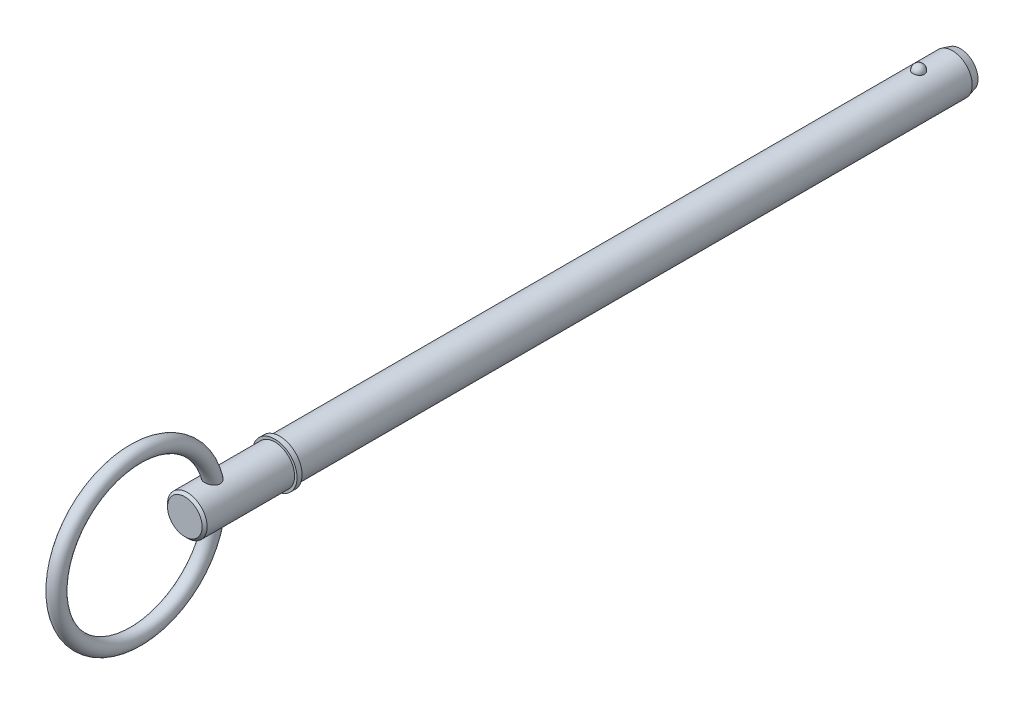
ISO-10303-21;
HEADER;
FILE_DESCRIPTION(('STEP AP214'),'2;1');
FILE_NAME('part.step','',(''),(''),'','','');
FILE_SCHEMA(('AUTOMOTIVE_DESIGN { 1 0 10303 214 1 1 1 1 }'));
ENDSEC;
DATA;
#1=APPLICATION_CONTEXT('core data for automotive mechanical design processes');
#2=APPLICATION_PROTOCOL_DEFINITION('international standard','automotive_design',2000,#1);
#3=PRODUCT_CONTEXT('',#1,'mechanical');
#4=PRODUCT('Part','Part','',(#3));
#5=PRODUCT_RELATED_PRODUCT_CATEGORY('part','',(#4));
#6=PRODUCT_DEFINITION_FORMATION('','',#4);
#7=PRODUCT_DEFINITION_CONTEXT('part definition',#1,'design');
#8=PRODUCT_DEFINITION('design','',#6,#7);
#9=PRODUCT_DEFINITION_SHAPE('','',#8);
#10=(LENGTH_UNIT() NAMED_UNIT(*) SI_UNIT(.MILLI.,.METRE.));
#11=(NAMED_UNIT(*) PLANE_ANGLE_UNIT() SI_UNIT($,.RADIAN.));
#12=(NAMED_UNIT(*) SI_UNIT($,.STERADIAN.) SOLID_ANGLE_UNIT());
#13=UNCERTAINTY_MEASURE_WITH_UNIT(LENGTH_MEASURE(1.E-05),#10,'distance_accuracy_value','');
#14=(GEOMETRIC_REPRESENTATION_CONTEXT(3) GLOBAL_UNCERTAINTY_ASSIGNED_CONTEXT((#13)) GLOBAL_UNIT_ASSIGNED_CONTEXT((#10,
#11,#12)) REPRESENTATION_CONTEXT('',''));
#15=CARTESIAN_POINT('',(0.,0.,0.));
#16=DIRECTION('',(0.,0.,1.));
#17=DIRECTION('',(1.,0.,0.));
#18=AXIS2_PLACEMENT_3D('',#15,#16,#17);
#19=CARTESIAN_POINT('',(0.,0.,127.));
#20=DIRECTION('',(0.,0.,-1.));
#21=DIRECTION('',(-1.,0.,0.));
#22=AXIS2_PLACEMENT_3D('',#19,#20,#21);
#23=CYLINDRICAL_SURFACE('',#22,3.97);
#24=CARTESIAN_POINT('',(1.13787398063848,3.80343828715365,-1.14999999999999));
#25=CARTESIAN_POINT('',(1.13787307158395,3.80343910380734,-1.08573978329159));
#26=CARTESIAN_POINT('',(1.13264657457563,3.80501406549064,-1.02146820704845));
#27=CARTESIAN_POINT('',(1.11186534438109,3.81113760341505,-0.89474994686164));
#28=CARTESIAN_POINT('',(1.09630734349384,3.81568712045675,-0.832303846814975));
#29=CARTESIAN_POINT('',(1.05525533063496,3.82724281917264,-0.711040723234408));
#30=CARTESIAN_POINT('',(1.02976565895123,3.83424792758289,-0.652222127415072));
#31=CARTESIAN_POINT('',(0.969477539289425,3.84993235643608,-0.539814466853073));
#32=CARTESIAN_POINT('',(0.934679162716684,3.85861166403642,-0.486225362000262));
#33=CARTESIAN_POINT('',(0.856427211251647,3.87673176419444,-0.385470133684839));
#34=CARTESIAN_POINT('',(0.812928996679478,3.88617632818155,-0.338339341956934));
#35=CARTESIAN_POINT('',(0.718506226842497,3.90473543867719,-0.252134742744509));
#36=CARTESIAN_POINT('',(0.667581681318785,3.91384998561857,-0.213060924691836));
#37=CARTESIAN_POINT('',(0.559829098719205,3.93070626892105,-0.144169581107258));
#38=CARTESIAN_POINT('',(0.503019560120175,3.93845211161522,-0.114324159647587));
#39=CARTESIAN_POINT('',(0.384957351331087,3.95173781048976,-0.0645874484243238));
#40=CARTESIAN_POINT('',(0.323705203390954,3.95727792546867,-0.044694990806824));
#41=CARTESIAN_POINT('',(0.1997490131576,3.96544869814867,-0.015729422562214));
#42=CARTESIAN_POINT('',(0.137095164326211,3.96813298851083,-0.00645660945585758));
#43=CARTESIAN_POINT('',(0.0110617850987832,3.97048461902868,0.0016793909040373));
#44=CARTESIAN_POINT('',(-0.0523176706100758,3.97015226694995,0.00054364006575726));
#45=CARTESIAN_POINT('',(-0.176983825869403,3.96653606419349,-0.0120046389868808));
#46=CARTESIAN_POINT('',(-0.238287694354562,3.96329719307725,-0.0232605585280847));
#47=CARTESIAN_POINT('',(-0.358077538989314,3.95427494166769,-0.0555133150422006));
#48=CARTESIAN_POINT('',(-0.41656346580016,3.94849151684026,-0.0765103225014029));
#49=CARTESIAN_POINT('',(-0.529474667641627,3.9349475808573,-0.127824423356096));
#50=CARTESIAN_POINT('',(-0.583873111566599,3.92717527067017,-0.158197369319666));
#51=CARTESIAN_POINT('',(-0.686796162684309,3.9104901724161,-0.227402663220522));
#52=CARTESIAN_POINT('',(-0.735320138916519,3.90157726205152,-0.266235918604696));
#53=CARTESIAN_POINT('',(-0.826197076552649,3.88336108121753,-0.352210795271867));
#54=CARTESIAN_POINT('',(-0.868404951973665,3.87405356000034,-0.399504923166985));
#55=CARTESIAN_POINT('',(-0.944393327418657,3.85623507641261,-0.500572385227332));
#56=CARTESIAN_POINT('',(-0.978173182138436,3.84772417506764,-0.5543462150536));
#57=CARTESIAN_POINT('',(-1.036841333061,3.83233550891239,-0.66762403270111));
#58=CARTESIAN_POINT('',(-1.06161430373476,3.82547928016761,-0.727190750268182));
#59=CARTESIAN_POINT('',(-1.1010562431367,3.81431496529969,-0.849806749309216));
#60=CARTESIAN_POINT('',(-1.11572551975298,3.81000680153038,-0.9128559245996));
#61=CARTESIAN_POINT('',(-1.13455293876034,3.80444307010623,-1.0403529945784));
#62=CARTESIAN_POINT('',(-1.13875701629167,3.80317416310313,-1.10479351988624));
#63=CARTESIAN_POINT('',(-1.13668244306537,3.80379469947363,-1.23348881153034));
#64=CARTESIAN_POINT('',(-1.13040410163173,3.80568404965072,-1.29774358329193));
#65=CARTESIAN_POINT('',(-1.10758455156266,3.81238701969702,-1.42388263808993));
#66=CARTESIAN_POINT('',(-1.09109911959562,3.81718474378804,-1.48577787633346));
#67=CARTESIAN_POINT('',(-1.04831897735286,3.82915360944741,-1.60583632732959));
#68=CARTESIAN_POINT('',(-1.02202385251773,3.83632485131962,-1.66399938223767));
#69=CARTESIAN_POINT('',(-0.960087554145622,3.85229234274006,-1.77531672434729));
#70=CARTESIAN_POINT('',(-0.924393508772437,3.86109769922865,-1.82844028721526));
#71=CARTESIAN_POINT('',(-0.844617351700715,3.87932868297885,-1.9278464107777));
#72=CARTESIAN_POINT('',(-0.800534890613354,3.88875433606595,-1.97412868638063));
#73=CARTESIAN_POINT('',(-0.704909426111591,3.90722138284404,-2.05875748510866));
#74=CARTESIAN_POINT('',(-0.653336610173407,3.91626104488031,-2.09707073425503));
#75=CARTESIAN_POINT('',(-0.544251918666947,3.93290335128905,-2.16444159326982));
#76=CARTESIAN_POINT('',(-0.486740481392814,3.94050610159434,-2.19349988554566));
#77=CARTESIAN_POINT('',(-0.368186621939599,3.95333328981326,-2.2412060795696));
#78=CARTESIAN_POINT('',(-0.307200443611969,3.9585876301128,-2.25998559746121));
#79=CARTESIAN_POINT('',(-0.182787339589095,3.96627905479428,-2.28716436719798));
#80=CARTESIAN_POINT('',(-0.119360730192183,3.96871650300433,-2.29556495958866));
#81=CARTESIAN_POINT('',(0.00676344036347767,3.97048518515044,-2.30167748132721));
#82=CARTESIAN_POINT('',(0.0694499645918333,3.96987797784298,-2.29960123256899));
#83=CARTESIAN_POINT('',(0.193555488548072,3.96576491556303,-2.28530777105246));
#84=CARTESIAN_POINT('',(0.254974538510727,3.96225917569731,-2.2730909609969));
#85=CARTESIAN_POINT('',(0.374550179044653,3.95274547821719,-2.23893840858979));
#86=CARTESIAN_POINT('',(0.432719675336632,3.94674835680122,-2.21704472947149));
#87=CARTESIAN_POINT('',(0.544514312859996,3.93288448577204,-2.16414952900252));
#88=CARTESIAN_POINT('',(0.598139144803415,3.92501760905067,-2.13314738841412));
#89=CARTESIAN_POINT('',(0.700284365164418,3.90809781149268,-2.06228741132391));
#90=CARTESIAN_POINT('',(0.748708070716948,3.89902775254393,-2.0222943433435));
#91=CARTESIAN_POINT('',(0.838215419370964,3.88077133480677,-1.93481443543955));
#92=CARTESIAN_POINT('',(0.879297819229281,3.87158495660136,-1.88732632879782));
#93=CARTESIAN_POINT('',(0.953804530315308,3.85391414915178,-1.78516284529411));
#94=CARTESIAN_POINT('',(0.987071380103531,3.8454460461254,-1.73036973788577));
#95=CARTESIAN_POINT('',(1.04410491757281,3.83035507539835,-1.61582422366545));
#96=CARTESIAN_POINT('',(1.06787445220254,3.82373165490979,-1.55607330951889));
#97=CARTESIAN_POINT('',(1.10358064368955,3.813570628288,-1.43904746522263));
#98=CARTESIAN_POINT('',(1.11641754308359,3.80980198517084,-1.38206535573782));
#99=CARTESIAN_POINT('',(1.13356451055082,3.80473547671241,-1.26672526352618));
#100=CARTESIAN_POINT('',(1.13787480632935,3.80343754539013,-1.20836731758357));
#101=CARTESIAN_POINT('',(1.13787398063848,3.80343828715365,-1.14999999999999));
#102=B_SPLINE_CURVE_WITH_KNOTS('',3,(#24,#25,#26,#27,#28,#29,#30,#31,#32,#33,#34,#35,#36,#37,
#38,#39,#40,#41,#42,#43,#44,#45,#46,#47,#48,#49,#50,#51,#52,#53,#54,#55,#56,#57,#58,#59,#60,#61,
#62,#63,#64,#65,#66,#67,#68,#69,#70,#71,#72,#73,#74,#75,#76,#77,#78,#79,#80,#81,#82,#83,#84,#85,
#86,#87,#88,#89,#90,#91,#92,#93,#94,#95,#96,#97,#98,#99,#100,#101),.UNSPECIFIED.,.T.,.F.,(4,2,2,
2,2,2,2,2,2,2,2,2,2,2,2,2,2,2,2,2,2,2,2,2,2,2,2,2,2,2,2,2,2,2,2,2,2,2,4),(0.,0.192571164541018,
0.385203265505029,0.577751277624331,0.770297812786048,0.963858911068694,1.15741975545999,
1.35038964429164,1.54333688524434,1.73259288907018,1.92182958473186,2.10818732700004,
2.2945483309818,2.48204164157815,2.66955507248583,2.86087083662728,3.05220124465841,
3.24590171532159,3.43959628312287,3.63243915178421,3.82527632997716,4.01706893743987,
4.20886965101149,4.40177324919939,4.59468488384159,4.78838651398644,4.9820738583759,
5.17321934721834,5.36434014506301,5.55161251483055,5.7388774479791,5.92533626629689,
6.11180776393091,6.30129785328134,6.49082000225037,6.68388392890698,6.87688993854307,
7.05180628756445,7.22671796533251),.UNSPECIFIED.);
#103=CARTESIAN_POINT('',(1.13787398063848,3.80343828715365,-1.14999999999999));
#104=VERTEX_POINT('',#103);
#105=EDGE_CURVE('E101',#104,#104,#102,.T.);
#106=ORIENTED_EDGE('',*,*,#105,.T.);
#107=EDGE_LOOP('',(#106));
#108=FACE_BOUND('',#107,.T.);
#109=CARTESIAN_POINT('',(0.,0.,-7.94399999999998));
#110=DIRECTION('',(0.,0.,-1.));
#111=DIRECTION('',(-1.,0.,0.));
#112=AXIS2_PLACEMENT_3D('',#109,#110,#111);
#113=CIRCLE('',#112,3.97);
#114=CARTESIAN_POINT('',(-3.97,0.,-7.94399999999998));
#115=VERTEX_POINT('',#114);
#116=EDGE_CURVE('E109',#115,#115,#113,.F.);
#117=ORIENTED_EDGE('',*,*,#116,.T.);
#118=EDGE_LOOP('',(#117));
#119=FACE_BOUND('',#118,.T.);
#120=CARTESIAN_POINT('',(0.,0.,127.));
#121=DIRECTION('',(0.,0.,1.));
#122=DIRECTION('',(1.,0.,0.));
#123=AXIS2_PLACEMENT_3D('',#120,#121,#122);
#124=CIRCLE('',#123,3.97);
#125=CARTESIAN_POINT('',(3.97,0.,127.));
#126=VERTEX_POINT('',#125);
#127=EDGE_CURVE('E107',#126,#126,#124,.T.);
#128=ORIENTED_EDGE('',*,*,#127,.F.);
#129=EDGE_LOOP('',(#128));
#130=FACE_BOUND('',#129,.T.);
#131=ADVANCED_FACE('F39',(#108,#119,#130),#23,.T.);
#132=CARTESIAN_POINT('',(0.,0.,-9.53));
#133=DIRECTION('',(0.,0.,-1.));
#134=DIRECTION('',(-1.,0.,0.));
#135=AXIS2_PLACEMENT_3D('',#132,#133,#134);
#136=PLANE('',#135);
#137=CARTESIAN_POINT('',(0.,0.,-9.53));
#138=DIRECTION('',(0.,0.,-1.));
#139=DIRECTION('',(-1.,0.,0.));
#140=AXIS2_PLACEMENT_3D('',#137,#138,#139);
#141=CIRCLE('',#140,3.54503258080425);
#142=CARTESIAN_POINT('',(-3.54503258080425,0.,-9.53));
#143=VERTEX_POINT('',#142);
#144=EDGE_CURVE('E142',#143,#143,#141,.T.);
#145=ORIENTED_EDGE('',*,*,#144,.T.);
#146=EDGE_LOOP('',(#145));
#147=FACE_BOUND('',#146,.T.);
#148=ADVANCED_FACE('F87',(#147),#136,.T.);
#149=CARTESIAN_POINT('',(0.,0.,-9.53000000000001));
#150=DIRECTION('',(0.,0.,1.));
#151=DIRECTION('',(1.,0.,0.));
#152=AXIS2_PLACEMENT_3D('',#149,#150,#151);
#153=CONICAL_SURFACE('',#152,3.54503258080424,0.261799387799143);
#154=ORIENTED_EDGE('',*,*,#116,.F.);
#155=EDGE_LOOP('',(#154));
#156=FACE_BOUND('',#155,.T.);
#157=ORIENTED_EDGE('',*,*,#144,.F.);
#158=EDGE_LOOP('',(#157));
#159=FACE_BOUND('',#158,.T.);
#160=ADVANCED_FACE('F93',(#156,#159),#153,.T.);
#161=CARTESIAN_POINT('',(0.,3.97,-1.14999999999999));
#162=DIRECTION('',(0.,1.,0.));
#163=DIRECTION('',(0.,0.,-1.));
#164=AXIS2_PLACEMENT_3D('',#161,#162,#163);
#165=SPHERICAL_SURFACE('',#164,1.15);
#166=ORIENTED_EDGE('',*,*,#105,.F.);
#167=EDGE_LOOP('',(#166));
#168=FACE_BOUND('',#167,.T.);
#169=ADVANCED_FACE('F112',(#168),#165,.T.);
#170=CARTESIAN_POINT('',(0.,0.,127.));
#171=DIRECTION('',(0.,0.,-1.));
#172=DIRECTION('',(-1.,0.,0.));
#173=AXIS2_PLACEMENT_3D('',#170,#171,#172);
#174=PLANE('',#173);
#175=ORIENTED_EDGE('',*,*,#127,.T.);
#176=EDGE_LOOP('',(#175));
#177=FACE_BOUND('',#176,.T.);
#178=CARTESIAN_POINT('',(0.,0.,127.));
#179=DIRECTION('',(0.,0.,-1.));
#180=DIRECTION('',(-1.,0.,0.));
#181=AXIS2_PLACEMENT_3D('',#178,#179,#180);
#182=CIRCLE('',#181,4.47);
#183=CARTESIAN_POINT('',(-4.47,0.,127.));
#184=VERTEX_POINT('',#183);
#185=EDGE_CURVE('E108',#184,#184,#182,.T.);
#186=ORIENTED_EDGE('',*,*,#185,.T.);
#187=EDGE_LOOP('',(#186));
#188=FACE_BOUND('',#187,.T.);
#189=ADVANCED_FACE('F116',(#177,#188),#174,.T.);
#190=CARTESIAN_POINT('',(0.,0.,33.7287874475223));
#191=DIRECTION('',(0.,0.,-1.));
#192=DIRECTION('',(-1.,0.,0.));
#193=AXIS2_PLACEMENT_3D('',#190,#191,#192);
#194=CYLINDRICAL_SURFACE('',#193,4.47);
#195=CARTESIAN_POINT('',(0.,0.,128.));
#196=DIRECTION('',(0.,0.,-1.));
#197=DIRECTION('',(-1.,0.,0.));
#198=AXIS2_PLACEMENT_3D('',#195,#196,#197);
#199=CIRCLE('',#198,4.47);
#200=CARTESIAN_POINT('',(-4.47,0.,128.));
#201=VERTEX_POINT('',#200);
#202=EDGE_CURVE('E133',#201,#201,#199,.T.);
#203=ORIENTED_EDGE('',*,*,#202,.T.);
#204=EDGE_LOOP('',(#203));
#205=FACE_BOUND('',#204,.T.);
#206=ORIENTED_EDGE('',*,*,#185,.F.);
#207=EDGE_LOOP('',(#206));
#208=FACE_BOUND('',#207,.T.);
#209=ADVANCED_FACE('F120',(#205,#208),#194,.T.);
#210=CARTESIAN_POINT('',(0.,4.47,128.));
#211=DIRECTION('',(0.,0.,1.));
#212=DIRECTION('',(1.,0.,0.));
#213=AXIS2_PLACEMENT_3D('',#210,#211,#212);
#214=PLANE('',#213);
#215=CARTESIAN_POINT('',(0.,0.,128.));
#216=DIRECTION('',(0.,0.,1.));
#217=DIRECTION('',(1.,0.,0.));
#218=AXIS2_PLACEMENT_3D('',#215,#216,#217);
#219=CIRCLE('',#218,3.97);
#220=CARTESIAN_POINT('',(3.97,0.,128.));
#221=VERTEX_POINT('',#220);
#222=EDGE_CURVE('E111',#221,#221,#219,.T.);
#223=ORIENTED_EDGE('',*,*,#222,.F.);
#224=EDGE_LOOP('',(#223));
#225=FACE_BOUND('',#224,.T.);
#226=ORIENTED_EDGE('',*,*,#202,.F.);
#227=EDGE_LOOP('',(#226));
#228=FACE_BOUND('',#227,.T.);
#229=ADVANCED_FACE('F84',(#225,#228),#214,.T.);
#230=CARTESIAN_POINT('',(0.,0.,146.05));
#231=DIRECTION('',(0.,0.,-1.));
#232=DIRECTION('',(-1.,0.,0.));
#233=AXIS2_PLACEMENT_3D('',#230,#231,#232);
#234=CYLINDRICAL_SURFACE('',#233,3.97);
#235=CARTESIAN_POINT('',(-0.740636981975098,-3.90030215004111,139.194208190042));
#236=CARTESIAN_POINT('',(-0.667733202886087,-3.91414543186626,139.154930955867));
#237=CARTESIAN_POINT('',(-0.59134710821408,-3.92651643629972,139.121598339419));
#238=CARTESIAN_POINT('',(-0.433709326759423,-3.94703799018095,139.067541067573));
#239=CARTESIAN_POINT('',(-0.352458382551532,-3.95518918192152,139.04681449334));
#240=CARTESIAN_POINT('',(-0.187320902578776,-3.96644185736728,139.018426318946));
#241=CARTESIAN_POINT('',(-0.103433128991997,-3.9695409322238,139.010770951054));
#242=CARTESIAN_POINT('',(0.0645297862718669,-3.97036376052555,139.008726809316));
#243=CARTESIAN_POINT('',(0.148604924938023,-3.96808759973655,139.014337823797));
#244=CARTESIAN_POINT('',(0.313967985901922,-3.95842655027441,139.038610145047));
#245=CARTESIAN_POINT('',(0.39527075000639,-3.95107581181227,139.057184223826));
#246=CARTESIAN_POINT('',(0.553418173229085,-3.93204472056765,139.106869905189));
#247=CARTESIAN_POINT('',(0.630262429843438,-3.92036397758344,139.137982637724));
#248=CARTESIAN_POINT('',(0.777983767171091,-3.89375421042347,139.212373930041));
#249=CARTESIAN_POINT('',(0.848809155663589,-3.8788003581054,139.255746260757));
#250=CARTESIAN_POINT('',(0.98188081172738,-3.84727071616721,139.353651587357));
#251=CARTESIAN_POINT('',(1.04412630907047,-3.83069478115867,139.408185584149));
#252=CARTESIAN_POINT('',(1.15846819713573,-3.79768496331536,139.527439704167));
#253=CARTESIAN_POINT('',(1.21053047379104,-3.78125172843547,139.592192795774));
#254=CARTESIAN_POINT('',(1.30266807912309,-3.75050988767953,139.730169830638));
#255=CARTESIAN_POINT('',(1.34274789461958,-3.73620048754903,139.803390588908));
#256=CARTESIAN_POINT('',(1.40857853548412,-3.71187334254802,139.953627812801));
#257=CARTESIAN_POINT('',(1.43477198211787,-3.70172571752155,140.030429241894));
#258=CARTESIAN_POINT('',(1.47426417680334,-3.68617713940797,140.187721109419));
#259=CARTESIAN_POINT('',(1.48756557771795,-3.68077520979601,140.268210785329));
#260=CARTESIAN_POINT('',(1.5011302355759,-3.67526295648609,140.428277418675));
#261=CARTESIAN_POINT('',(1.50172918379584,-3.67501639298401,140.507822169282));
#262=CARTESIAN_POINT('',(1.49128692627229,-3.67926498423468,140.666001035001));
#263=CARTESIAN_POINT('',(1.48024221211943,-3.68376156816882,140.744634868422));
#264=CARTESIAN_POINT('',(1.44631002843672,-3.69722026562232,140.903996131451));
#265=CARTESIAN_POINT('',(1.42273446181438,-3.70644057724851,140.984553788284));
#266=CARTESIAN_POINT('',(1.36440745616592,-3.7283048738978,141.141022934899));
#267=CARTESIAN_POINT('',(1.32965006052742,-3.74095068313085,141.216931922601));
#268=CARTESIAN_POINT('',(1.24498396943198,-3.77003365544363,141.371589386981));
#269=CARTESIAN_POINT('',(1.1937475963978,-3.78674477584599,141.449562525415));
#270=CARTESIAN_POINT('',(1.07927226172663,-3.82094743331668,141.596060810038));
#271=CARTESIAN_POINT('',(1.01602347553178,-3.83843960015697,141.664578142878));
#272=CARTESIAN_POINT('',(0.875824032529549,-3.87288453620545,141.792242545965));
#273=CARTESIAN_POINT('',(0.798445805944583,-3.88979192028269,141.85093750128));
#274=CARTESIAN_POINT('',(0.63327143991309,-3.92005992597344,141.952448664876));
#275=CARTESIAN_POINT('',(0.545492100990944,-3.93342615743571,141.995290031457));
#276=CARTESIAN_POINT('',(0.374503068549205,-3.9531041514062,142.057302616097));
#277=CARTESIAN_POINT('',(0.292250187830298,-3.96011991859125,142.078871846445));
#278=CARTESIAN_POINT('',(0.124887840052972,-3.96891507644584,142.105817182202));
#279=CARTESIAN_POINT('',(0.03978221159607,-3.97070123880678,142.111214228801));
#280=CARTESIAN_POINT('',(-0.1165987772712,-3.96893737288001,142.105841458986));
#281=CARTESIAN_POINT('',(-0.187977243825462,-3.96616998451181,142.09744312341));
#282=CARTESIAN_POINT('',(-0.328224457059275,-3.95703238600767,142.06934593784));
#283=CARTESIAN_POINT('',(-0.397092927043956,-3.9506617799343,142.049645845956));
#284=CARTESIAN_POINT('',(-0.530777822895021,-3.93493622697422,142.000002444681));
#285=CARTESIAN_POINT('',(-0.595585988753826,-3.92557541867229,141.970039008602));
#286=CARTESIAN_POINT('',(-0.719890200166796,-3.904694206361,141.901221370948));
#287=CARTESIAN_POINT('',(-0.779384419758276,-3.89317306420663,141.862364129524));
#288=CARTESIAN_POINT('',(-0.900171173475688,-3.86715924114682,141.771135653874));
#289=CARTESIAN_POINT('',(-0.960570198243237,-3.85247602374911,141.717637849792));
#290=CARTESIAN_POINT('',(-1.07286582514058,-3.82272677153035,141.602437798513));
#291=CARTESIAN_POINT('',(-1.12475588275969,-3.8076604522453,141.54072930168));
#292=CARTESIAN_POINT('',(-1.22682603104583,-3.7761197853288,141.400307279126));
#293=CARTESIAN_POINT('',(-1.27547686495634,-3.75979238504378,141.320442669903));
#294=CARTESIAN_POINT('',(-1.35956460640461,-3.73021138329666,141.153453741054));
#295=CARTESIAN_POINT('',(-1.39499536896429,-3.71695921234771,141.066326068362));
#296=CARTESIAN_POINT('',(-1.45224550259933,-3.6949785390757,140.883764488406));
#297=CARTESIAN_POINT('',(-1.47355906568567,-3.68641985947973,140.788148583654));
#298=CARTESIAN_POINT('',(-1.49891316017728,-3.67618897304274,140.594306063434));
#299=CARTESIAN_POINT('',(-1.50297414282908,-3.67450861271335,140.496082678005));
#300=CARTESIAN_POINT('',(-1.49322338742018,-3.67847743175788,140.311520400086));
#301=CARTESIAN_POINT('',(-1.48132891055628,-3.68334053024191,140.225062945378));
#302=CARTESIAN_POINT('',(-1.44277978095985,-3.69860964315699,140.056020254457));
#303=CARTESIAN_POINT('',(-1.4161310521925,-3.70901343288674,139.973433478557));
#304=CARTESIAN_POINT('',(-1.35164005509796,-3.73296583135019,139.821743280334));
#305=CARTESIAN_POINT('',(-1.31494998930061,-3.74616939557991,139.752090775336));
#306=CARTESIAN_POINT('',(-1.23078033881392,-3.77465882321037,139.620114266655));
#307=CARTESIAN_POINT('',(-1.18329862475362,-3.78994509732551,139.55779171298));
#308=CARTESIAN_POINT('',(-1.07555346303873,-3.82196646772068,139.438244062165));
#309=CARTESIAN_POINT('',(-1.01467770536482,-3.83873247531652,139.38157898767));
#310=CARTESIAN_POINT('',(-0.883925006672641,-3.87093079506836,139.279334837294));
#311=CARTESIAN_POINT('',(-0.814046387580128,-3.88636285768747,139.233757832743));
#312=CARTESIAN_POINT('',(-0.740636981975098,-3.90030215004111,139.194208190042));
#313=B_SPLINE_CURVE_WITH_KNOTS('',3,(#235,#236,#237,#238,#239,#240,#241,#242,#243,#244,#245,
#246,#247,#248,#249,#250,#251,#252,#253,#254,#255,#256,#257,#258,#259,#260,#261,#262,#263,#264,
#265,#266,#267,#268,#269,#270,#271,#272,#273,#274,#275,#276,#277,#278,#279,#280,#281,#282,#283,
#284,#285,#286,#287,#288,#289,#290,#291,#292,#293,#294,#295,#296,#297,#298,#299,#300,#301,#302,
#303,#304,#305,#306,#307,#308,#309,#310,#311,#312),.UNSPECIFIED.,.T.,.F.,(4,2,2,2,2,2,2,2,2,2,2,
2,2,2,2,2,2,2,2,2,2,2,2,2,2,2,2,2,2,2,2,2,2,2,2,2,2,2,4),(0.,0.251585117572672,
0.503131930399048,0.754798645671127,1.00646134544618,1.25644674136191,1.50645467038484,
1.75842915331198,2.01042624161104,2.26325358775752,2.51598614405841,2.76008726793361,
3.00413815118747,3.24173115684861,3.47939577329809,3.73171171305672,3.98416228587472,
4.26728153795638,4.55063334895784,4.84469622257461,5.13829042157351,5.39265192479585,
5.6466839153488,5.86142364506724,6.07618697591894,6.29137389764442,6.50663447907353,
6.75172833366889,6.9970098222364,7.28055118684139,7.56422418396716,7.85757857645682,
8.15058512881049,8.41135406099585,8.6720183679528,8.91039015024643,9.14880900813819,
9.40209172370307,9.65542171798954),.UNSPECIFIED.);
#314=CARTESIAN_POINT('',(-0.740636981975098,-3.90030215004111,139.194208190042));
#315=VERTEX_POINT('',#314);
#316=EDGE_CURVE('E10',#315,#315,#313,.T.);
#317=ORIENTED_EDGE('',*,*,#316,.F.);
#318=EDGE_LOOP('',(#317));
#319=FACE_BOUND('',#318,.T.);
#320=CARTESIAN_POINT('',(-0.740636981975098,3.90030215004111,139.194208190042));
#321=CARTESIAN_POINT('',(-0.813118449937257,3.88653971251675,139.233257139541));
#322=CARTESIAN_POINT('',(-0.882149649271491,3.8713229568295,139.27817811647));
#323=CARTESIAN_POINT('',(-1.01146335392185,3.83956738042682,139.378842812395));
#324=CARTESIAN_POINT('',(-1.07174704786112,3.82302873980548,139.434585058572));
#325=CARTESIAN_POINT('',(-1.18196955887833,3.79040422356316,139.555793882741));
#326=CARTESIAN_POINT('',(-1.23189269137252,3.77431906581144,139.621274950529));
#327=CARTESIAN_POINT('',(-1.31978443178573,3.74449359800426,139.760294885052));
#328=CARTESIAN_POINT('',(-1.35775694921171,3.73075252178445,139.833831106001));
#329=CARTESIAN_POINT('',(-1.41974909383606,3.7075981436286,139.984712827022));
#330=CARTESIAN_POINT('',(-1.44413408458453,3.69807309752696,140.061891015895));
#331=CARTESIAN_POINT('',(-1.4800654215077,3.6838411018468,140.219590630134));
#332=CARTESIAN_POINT('',(-1.49161368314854,3.67913343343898,140.300111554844));
#333=CARTESIAN_POINT('',(-1.50187378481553,3.67495610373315,140.460261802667));
#334=CARTESIAN_POINT('',(-1.50086613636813,3.67537197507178,140.539870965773));
#335=CARTESIAN_POINT('',(-1.48728932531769,3.68088569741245,140.69791727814));
#336=CARTESIAN_POINT('',(-1.47471654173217,3.68598501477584,140.776354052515));
#337=CARTESIAN_POINT('',(-1.43761932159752,3.70061780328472,140.93559408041));
#338=CARTESIAN_POINT('',(-1.41233843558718,3.71042990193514,141.016194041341));
#339=CARTESIAN_POINT('',(-1.3505731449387,3.73335405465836,141.172485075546));
#340=CARTESIAN_POINT('',(-1.31408239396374,3.74646797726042,141.248173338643));
#341=CARTESIAN_POINT('',(-1.22571722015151,3.77636700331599,141.402042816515));
#342=CARTESIAN_POINT('',(-1.17251505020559,3.79340436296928,141.479416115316));
#343=CARTESIAN_POINT('',(-1.05406412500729,3.82800923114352,141.624306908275));
#344=CARTESIAN_POINT('',(-0.988806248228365,3.84557713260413,141.691816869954));
#345=CARTESIAN_POINT('',(-0.845287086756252,3.87968695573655,141.816221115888));
#346=CARTESIAN_POINT('',(-0.766724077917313,3.89618874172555,141.87278225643));
#347=CARTESIAN_POINT('',(-0.599538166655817,3.92537936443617,141.969696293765));
#348=CARTESIAN_POINT('',(-0.510933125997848,3.93807482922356,142.010077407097));
#349=CARTESIAN_POINT('',(-0.339677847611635,3.95624165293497,142.067008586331));
#350=CARTESIAN_POINT('',(-0.257968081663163,3.96248273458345,142.086128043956));
#351=CARTESIAN_POINT('',(-0.0922002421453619,3.96979198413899,142.10847364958));
#352=CARTESIAN_POINT('',(-0.00814495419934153,3.97086604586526,142.111717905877));
#353=CARTESIAN_POINT('',(0.146484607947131,3.96793776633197,142.102797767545));
#354=CARTESIAN_POINT('',(0.217212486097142,3.96466338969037,142.092843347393));
#355=CARTESIAN_POINT('',(0.355938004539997,3.95462310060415,142.06188886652));
#356=CARTESIAN_POINT('',(0.423935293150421,3.94785673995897,142.040887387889));
#357=CARTESIAN_POINT('',(0.556534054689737,3.93137424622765,141.988614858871));
#358=CARTESIAN_POINT('',(0.621075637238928,3.92161865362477,141.957205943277));
#359=CARTESIAN_POINT('',(0.744663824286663,3.90004074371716,141.88557567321));
#360=CARTESIAN_POINT('',(0.803708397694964,3.88821766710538,141.845351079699));
#361=CARTESIAN_POINT('',(0.923664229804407,3.86161149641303,141.751056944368));
#362=CARTESIAN_POINT('',(0.983622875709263,3.84664723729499,141.695828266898));
#363=CARTESIAN_POINT('',(1.09477654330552,3.816501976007,141.577194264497));
#364=CARTESIAN_POINT('',(1.14596459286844,3.80132081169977,141.51378250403));
#365=CARTESIAN_POINT('',(1.24603510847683,3.76980809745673,141.369989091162));
#366=CARTESIAN_POINT('',(1.29338223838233,3.75365286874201,141.288493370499));
#367=CARTESIAN_POINT('',(1.37450267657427,3.72471527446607,141.11839607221));
#368=CARTESIAN_POINT('',(1.40827109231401,3.7119341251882,141.029791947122));
#369=CARTESIAN_POINT('',(1.46140533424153,3.6913461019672,140.84554366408));
#370=CARTESIAN_POINT('',(1.48042991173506,3.6836576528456,140.74978594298));
#371=CARTESIAN_POINT('',(1.50115029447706,3.67526750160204,140.556128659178));
#372=CARTESIAN_POINT('',(1.50286713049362,3.67455732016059,140.458231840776));
#373=CARTESIAN_POINT('',(1.48878143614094,3.68028077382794,140.275208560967));
#374=CARTESIAN_POINT('',(1.47496153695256,3.68590609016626,140.18990287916));
#375=CARTESIAN_POINT('',(1.43287242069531,3.70247002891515,140.023476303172));
#376=CARTESIAN_POINT('',(1.40460762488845,3.7134070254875,139.94235413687));
#377=CARTESIAN_POINT('',(1.33714680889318,3.7381964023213,139.793104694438));
#378=CARTESIAN_POINT('',(1.2989833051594,3.7517524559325,139.724457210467));
#379=CARTESIAN_POINT('',(1.21206000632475,3.78072797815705,139.594682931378));
#380=CARTESIAN_POINT('',(1.16329942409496,3.79614758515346,139.533556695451));
#381=CARTESIAN_POINT('',(1.05526740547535,3.82760231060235,139.418865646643));
#382=CARTESIAN_POINT('',(0.995782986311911,3.84364346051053,139.365503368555));
#383=CARTESIAN_POINT('',(0.868651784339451,3.8743538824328,139.26909984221));
#384=CARTESIAN_POINT('',(0.801003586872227,3.88902291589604,139.226060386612));
#385=CARTESIAN_POINT('',(0.656696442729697,3.91602140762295,139.149789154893));
#386=CARTESIAN_POINT('',(0.579799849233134,3.92824686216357,139.11696915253));
#387=CARTESIAN_POINT('',(0.421219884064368,3.94839960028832,139.064037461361));
#388=CARTESIAN_POINT('',(0.339536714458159,3.95632706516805,139.043925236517));
#389=CARTESIAN_POINT('',(0.173681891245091,3.96706909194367,139.016866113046));
#390=CARTESIAN_POINT('',(0.0895101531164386,3.96988347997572,139.009919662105));
#391=CARTESIAN_POINT('',(-0.0788915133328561,3.97010941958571,139.009358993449));
#392=CARTESIAN_POINT('',(-0.163121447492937,3.96752031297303,139.015746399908));
#393=CARTESIAN_POINT('',(-0.332911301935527,3.9569711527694,139.042287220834));
#394=CARTESIAN_POINT('',(-0.418363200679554,3.9487768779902,139.063041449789));
#395=CARTESIAN_POINT('',(-0.584033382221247,3.92769448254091,139.118425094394));
#396=CARTESIAN_POINT('',(-0.664251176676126,3.91480592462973,139.153055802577));
#397=CARTESIAN_POINT('',(-0.740636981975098,3.90030215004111,139.194208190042));
#398=B_SPLINE_CURVE_WITH_KNOTS('',3,(#320,#321,#322,#323,#324,#325,#326,#327,#328,#329,#330,
#331,#332,#333,#334,#335,#336,#337,#338,#339,#340,#341,#342,#343,#344,#345,#346,#347,#348,#349,
#350,#351,#352,#353,#354,#355,#356,#357,#358,#359,#360,#361,#362,#363,#364,#365,#366,#367,#368,
#369,#370,#371,#372,#373,#374,#375,#376,#377,#378,#379,#380,#381,#382,#383,#384,#385,#386,#387,
#388,#389,#390,#391,#392,#393,#394,#395,#396,#397),.UNSPECIFIED.,.T.,.F.,(4,2,2,2,2,2,2,2,2,2,2,
2,2,2,2,2,2,2,2,2,2,2,2,2,2,2,2,2,2,2,2,2,2,2,2,2,2,2,4),(0.,0.250115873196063,
0.500197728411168,0.750655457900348,1.00103116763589,1.24430196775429,1.48753646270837,
1.72534678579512,1.96323159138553,2.21733609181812,2.47158471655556,2.75662009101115,
3.04187201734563,3.33477180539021,3.62715855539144,3.8780351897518,4.12862559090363,
4.34211896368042,4.55563974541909,4.77211030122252,4.98866052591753,5.23635199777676,
5.48423946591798,5.7698368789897,6.05553710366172,6.34766729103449,6.63944246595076,
6.89782349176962,7.156125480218,7.3941467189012,7.63218564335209,7.87561406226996,
8.11908472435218,8.37137533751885,8.62365530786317,8.87594385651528,9.12826313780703,
9.3918273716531,9.65541616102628),.UNSPECIFIED.);
#399=CARTESIAN_POINT('',(-0.740636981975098,3.90030215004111,139.194208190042));
#400=VERTEX_POINT('',#399);
#401=EDGE_CURVE('E51',#400,#400,#398,.T.);
#402=ORIENTED_EDGE('',*,*,#401,.F.);
#403=EDGE_LOOP('',(#402));
#404=FACE_BOUND('',#403,.T.);
#405=CARTESIAN_POINT('',(0.,0.,145.55));
#406=DIRECTION('',(0.,0.,-1.));
#407=DIRECTION('',(-1.,0.,0.));
#408=AXIS2_PLACEMENT_3D('',#405,#406,#407);
#409=CIRCLE('',#408,3.97);
#410=CARTESIAN_POINT('',(-3.97,0.,145.55));
#411=VERTEX_POINT('',#410);
#412=EDGE_CURVE('E63',#411,#411,#409,.T.);
#413=ORIENTED_EDGE('',*,*,#412,.T.);
#414=EDGE_LOOP('',(#413));
#415=FACE_BOUND('',#414,.T.);
#416=ORIENTED_EDGE('',*,*,#222,.T.);
#417=EDGE_LOOP('',(#416));
#418=FACE_BOUND('',#417,.T.);
#419=ADVANCED_FACE('F68',(#319,#404,#415,#418),#234,.T.);
#420=CARTESIAN_POINT('',(0.,0.,146.05));
#421=DIRECTION('',(0.,0.,-1.));
#422=DIRECTION('',(-1.,0.,0.));
#423=AXIS2_PLACEMENT_3D('',#420,#421,#422);
#424=PLANE('',#423);
#425=CARTESIAN_POINT('',(0.,0.,146.05));
#426=DIRECTION('',(0.,0.,-1.));
#427=DIRECTION('',(-1.,0.,0.));
#428=AXIS2_PLACEMENT_3D('',#425,#426,#427);
#429=CIRCLE('',#428,3.46999999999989);
#430=CARTESIAN_POINT('',(-3.46999999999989,0.,146.05));
#431=VERTEX_POINT('',#430);
#432=EDGE_CURVE('E58',#431,#431,#429,.F.);
#433=ORIENTED_EDGE('',*,*,#432,.T.);
#434=EDGE_LOOP('',(#433));
#435=FACE_BOUND('',#434,.T.);
#436=ADVANCED_FACE('F75',(#435),#424,.F.);
#437=CARTESIAN_POINT('',(0.,0.,145.55));
#438=DIRECTION('',(0.,0.,-1.));
#439=DIRECTION('',(-1.,0.,0.));
#440=AXIS2_PLACEMENT_3D('',#437,#438,#439);
#441=CONICAL_SURFACE('',#440,3.97,0.785398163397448);
#442=ORIENTED_EDGE('',*,*,#432,.F.);
#443=EDGE_LOOP('',(#442));
#444=FACE_BOUND('',#443,.T.);
#445=ORIENTED_EDGE('',*,*,#412,.F.);
#446=EDGE_LOOP('',(#445));
#447=FACE_BOUND('',#446,.T.);
#448=ADVANCED_FACE('F41',(#444,#447),#441,.T.);
#449=CARTESIAN_POINT('',(0.,0.,155.925));
#450=DIRECTION('',(1.,0.,0.));
#451=DIRECTION('',(0.,0.,-1.));
#452=AXIS2_PLACEMENT_3D('',#449,#450,#451);
#453=TOROIDAL_SURFACE('',#452,15.875,1.5);
#454=ORIENTED_EDGE('',*,*,#316,.T.);
#455=EDGE_LOOP('',(#454));
#456=FACE_BOUND('',#455,.T.);
#457=ORIENTED_EDGE('',*,*,#401,.T.);
#458=EDGE_LOOP('',(#457));
#459=FACE_BOUND('',#458,.T.);
#460=ADVANCED_FACE('F72',(#456,#459),#453,.T.);
#461=CLOSED_SHELL('',(#131,#148,#160,#169,#189,#209,#229,#419,#436,#448,#460));
#462=MANIFOLD_SOLID_BREP('B2',#461);
#463=ADVANCED_BREP_SHAPE_REPRESENTATION('',(#18,#462),#14);
#464=SHAPE_DEFINITION_REPRESENTATION(#9,#463);
ENDSEC;
END-ISO-10303-21;
